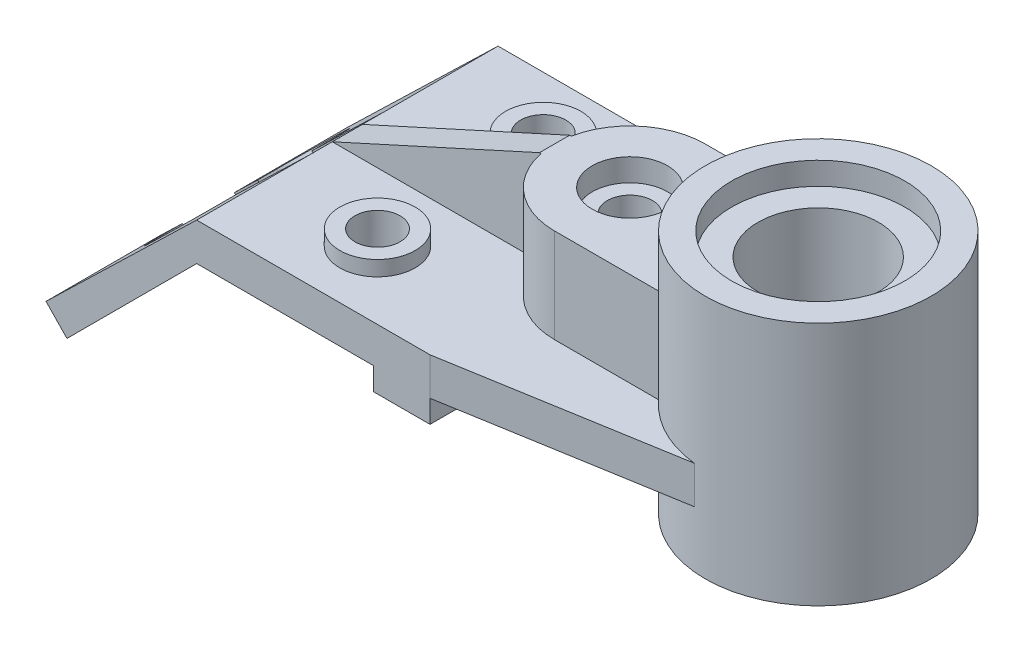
from build123d import *

# Parameters (mm, degrees)
SKETCH2_R                 = 30
BOSS_EXTRUDE2_DEPTH       = 65
SKETCH4_R                 = 23
CUT_EXTRUDE1_DEPTH        = 6
SKETCH5_R                 = 16
CUT_EXTRUDE2_DEPTH        = 110
BOSS_EXTRUDE4_DEPTH       = 10
BOSS_EXTRUDE5_DEPTH       = 25
SKETCH13_R                = 10
CUT_EXTRUDE3_DEPTH        = 6
SKETCH14_R                = 6
CUT_EXTRUDE4_DEPTH        = 35
SKETCH15_R                = 10
BOSS_EXTRUDE6_DEPTH       = 4
SKETCH16_R                = 6
CUT_EXTRUDE5_DEPTH        = 24
SKETCH17_R                = 6
CUT_EXTRUDE6_DEPTH        = 24
BOSS_EXTRUDE10_DEPTH      = 4
BOSS_EXTRUDE10_DEPTH_BACK = 4
BOSS_EXTRUDE11_DEPTH      = 80
CUT_EXTRUDE7_DEPTH        = 80
SKETCH26_W                = 55.348835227
SKETCH26_H                = 20
CUT_EXTRUDE8_DEPTH        = 2
SKETCH28_W                = 15
SKETCH28_H                = 6
BOSS_EXTRUDE14_DEPTH      = 80


with BuildPart() as part:
    # Sketch2 → Boss-Extrude2 (new body)
    with BuildSketch(Plane(origin=(0, 0, 0), x_dir=(1, 0, 0), z_dir=(0, 1, 0))):
        with Locations(Location((-8.519964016, 5.291408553, 0), (0, 0, 270))):
            Circle(SKETCH2_R)
    extrude(amount=BOSS_EXTRUDE2_DEPTH)

    # Sketch4 → Cut-Extrude1 (cut)
    with BuildSketch(Plane(origin=(0, 65, 0), x_dir=(1, 0, 0), z_dir=(0, 1, 0))):
        with Locations(Location((-8.519964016, 5.291408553, 0), (0, 0, 270))):
            Circle(SKETCH4_R)
    extrude(amount=-CUT_EXTRUDE1_DEPTH, mode=Mode.SUBTRACT)

    # Sketch5 → Cut-Extrude2 (cut)
    with BuildSketch(Plane(origin=(0, 59, 0), x_dir=(1, 0, 0), z_dir=(0, 1, 0))):
        with Locations(Location((-8.519964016, 5.291408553, 0), (0, 0, 270))):
            Circle(SKETCH5_R)
    extrude(amount=-CUT_EXTRUDE2_DEPTH, mode=Mode.SUBTRACT)

    # Sketch11 → Boss-Extrude4 (add)
    with BuildSketch(Plane(origin=(0, 15, 0), x_dir=(1, 0, 0), z_dir=(0, 1, 0))):
        with BuildLine():
            Line((-11.573258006, 35.135627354), (-71.573258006, 45.291408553))
            Line((-71.573258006, 45.291408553), (-133.519964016, 45.291408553))
            Line((-133.519964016, 45.291408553), (-133.519964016, -34.708591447))
            Line((-133.519964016, -34.708591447), (-71.573258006, -34.708591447))
            Line((-71.573258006, -34.708591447), (-11.573258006, -24.552810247))
            ThreePointArc((-11.573258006, -24.552810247), (-38.519964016, 5.291408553), (-11.573258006, 35.135627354))
        make_face()
    extrude(amount=BOSS_EXTRUDE4_DEPTH)

    # Sketch12 → Boss-Extrude5 (add)
    with BuildSketch(Plane(origin=(0, 25, 0), x_dir=(1, 0, 0), z_dir=(0, 1, 0))):
        with BuildLine():
            Line((-58.519964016, 25.291408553), (-30.880643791, 25.291408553))
            Line((-30.880643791, 25.291408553), (-30.880643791, -14.708591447))
            Line((-30.880643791, -14.708591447), (-58.519964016, -14.708591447))
            ThreePointArc((-58.519964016, -14.708591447), (-78.519964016, 5.291408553), (-58.519964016, 25.291408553))
        make_face()
    extrude(amount=BOSS_EXTRUDE5_DEPTH)

    # Sketch13 → Cut-Extrude3 (cut)
    with BuildSketch(Plane(origin=(0, 50, 0), x_dir=(1, 0, 0), z_dir=(0, 1, 0))):
        with Locations(Location((-58.519964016, 5.291408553, 0), (0, 0, 270))):
            Circle(SKETCH13_R)
    extrude(amount=-CUT_EXTRUDE3_DEPTH, mode=Mode.SUBTRACT)

    # Sketch14 → Cut-Extrude4 (cut)
    with BuildSketch(Plane(origin=(0, 44, 0), x_dir=(1, 0, 0), z_dir=(0, 1, 0))):
        with Locations(Location((-58.519964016, 5.291408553, 0), (0, 0, 270))):
            Circle(SKETCH14_R)
    extrude(amount=-CUT_EXTRUDE4_DEPTH, mode=Mode.SUBTRACT)

    # Sketch15 → Boss-Extrude6 (add)
    with BuildSketch(Plane(origin=(0, 25, 0), x_dir=(1, 0, 0), z_dir=(0, 1, 0))):
        with Locations(Location((-103.519964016, 27.291408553, 0), (0, 0, 90))):
            Circle(SKETCH15_R)
        with Locations(Location((-103.519964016, -16.708591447, 0), (0, 0, 90))):
            Circle(SKETCH15_R)
    extrude(amount=BOSS_EXTRUDE6_DEPTH)

    # Sketch16 → Cut-Extrude5 (cut)
    with BuildSketch(Plane(origin=(0, 29, 0), x_dir=(1, 0, 0), z_dir=(0, 1, 0))):
        with Locations(Location((-103.519964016, 27.291408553, 0), (0, 0, 270))):
            Circle(SKETCH16_R)
    extrude(amount=-CUT_EXTRUDE5_DEPTH, mode=Mode.SUBTRACT)

    # Sketch17 → Cut-Extrude6 (cut)
    with BuildSketch(Plane(origin=(0, 29, 0), x_dir=(1, 0, 0), z_dir=(0, 1, 0))):
        with Locations(Location((-103.519964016, -16.708591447, 0), (0, 0, 270))):
            Circle(SKETCH17_R)
    extrude(amount=-CUT_EXTRUDE6_DEPTH, mode=Mode.SUBTRACT)

    # Sketch22 → Boss-Extrude10 (add, two sides: drawn at the far end of the back side and taken through both)
    with BuildSketch(Plane.XY.offset(-5.291408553).offset(-BOSS_EXTRUDE10_DEPTH_BACK)):
        Polygon((-133.519964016, 25), (-78.519964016, 50), (-68.519964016, 50), (-68.519964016, 25), align=None)
    extrude(amount=BOSS_EXTRUDE10_DEPTH + BOSS_EXTRUDE10_DEPTH_BACK)

    # Sketch24 → Boss-Extrude11 (add)
    with BuildSketch(Plane.XY.offset(34.708591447)):
        Polygon((-133.519964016, 25), (-173.519964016, -13.687864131), (-167.958212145, -19.438248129), (-133.519964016, 15), align=None)
    extrude(amount=-BOSS_EXTRUDE11_DEPTH)

    # Sketch25 → Cut-Extrude7 (cut)
    with BuildSketch(Plane(origin=(-77.02717921, 79.639629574, 0), x_dir=(0.7187979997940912, 0.6952189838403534, 0), z_dir=(-0.6952189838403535, 0.7187979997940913, 0))):
        with BuildLine():
            Line((-105.606502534, 20.291408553), (-105.606502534, -9.708591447))
            ThreePointArc((-105.606502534, -9.708591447), (-115.606502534, -19.708591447), (-125.606502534, -9.708591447))
            Line((-125.606502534, -9.708591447), (-125.606502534, 20.291408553))
            ThreePointArc((-125.606502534, 20.291408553), (-115.606502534, 30.291408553), (-105.606502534, 20.291408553))
        make_face()
    extrude(amount=-CUT_EXTRUDE7_DEPTH, mode=Mode.SUBTRACT)

    # Sketch26 → Cut-Extrude8 (cut)
    with BuildSketch(Plane(origin=(-77.02717921, 79.639629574, 0), x_dir=(0.7187979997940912, 0.6952189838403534, 0), z_dir=(-0.6952189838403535, 0.7187979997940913, 0))):
        with Locations((-106.567448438, 5.291408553)):
            Rectangle(SKETCH26_W, SKETCH26_H)
    extrude(amount=-CUT_EXTRUDE8_DEPTH, mode=Mode.SUBTRACT)

    # Sketch28 → Boss-Extrude14 (add)
    with BuildSketch(Plane.XY.offset(34.708591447)):
        with Locations((-79.073258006, 12)):
            Rectangle(SKETCH28_W, SKETCH28_H)
    extrude(amount=-BOSS_EXTRUDE14_DEPTH)


solid = part.part
